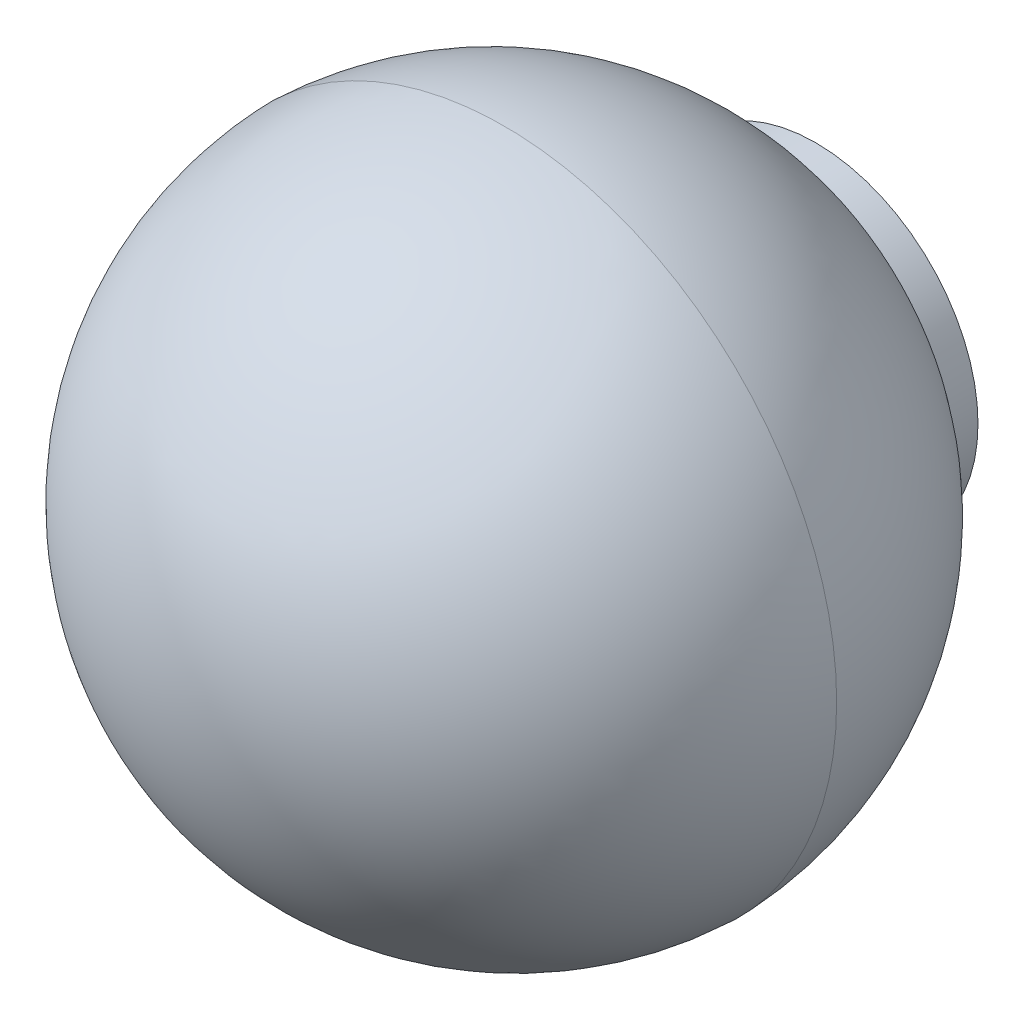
ISO-10303-21;
HEADER;
FILE_DESCRIPTION(('STEP AP214'),'2;1');
FILE_NAME('part.step','',(''),(''),'','','');
FILE_SCHEMA(('AUTOMOTIVE_DESIGN { 1 0 10303 214 1 1 1 1 }'));
ENDSEC;
DATA;
#1=APPLICATION_CONTEXT('core data for automotive mechanical design processes');
#2=APPLICATION_PROTOCOL_DEFINITION('international standard','automotive_design',2000,#1);
#3=PRODUCT_CONTEXT('',#1,'mechanical');
#4=PRODUCT('Part','Part','',(#3));
#5=PRODUCT_RELATED_PRODUCT_CATEGORY('part','',(#4));
#6=PRODUCT_DEFINITION_FORMATION('','',#4);
#7=PRODUCT_DEFINITION_CONTEXT('part definition',#1,'design');
#8=PRODUCT_DEFINITION('design','',#6,#7);
#9=PRODUCT_DEFINITION_SHAPE('','',#8);
#10=(LENGTH_UNIT() NAMED_UNIT(*) SI_UNIT(.MILLI.,.METRE.));
#11=(NAMED_UNIT(*) PLANE_ANGLE_UNIT() SI_UNIT($,.RADIAN.));
#12=(NAMED_UNIT(*) SI_UNIT($,.STERADIAN.) SOLID_ANGLE_UNIT());
#13=UNCERTAINTY_MEASURE_WITH_UNIT(LENGTH_MEASURE(1.E-05),#10,'distance_accuracy_value','');
#14=(GEOMETRIC_REPRESENTATION_CONTEXT(3) GLOBAL_UNCERTAINTY_ASSIGNED_CONTEXT((#13)) GLOBAL_UNIT_ASSIGNED_CONTEXT((#10,
#11,#12)) REPRESENTATION_CONTEXT('',''));
#15=CARTESIAN_POINT('',(0.,0.,0.));
#16=DIRECTION('',(0.,0.,1.));
#17=DIRECTION('',(1.,0.,0.));
#18=AXIS2_PLACEMENT_3D('',#15,#16,#17);
#19=CARTESIAN_POINT('',(0.,0.,19.4624597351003));
#20=DIRECTION('',(0.,0.,-1.));
#21=DIRECTION('',(1.,0.,0.));
#22=AXIS2_PLACEMENT_3D('',#19,#20,#21);
#23=SPHERICAL_SURFACE('',#22,20.);
#24=CARTESIAN_POINT('',(0.,0.,18.7312298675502));
#25=DIRECTION('',(0.,0.,-1.));
#26=DIRECTION('',(0.,1.,0.));
#27=AXIS2_PLACEMENT_3D('',#24,#25,#26);
#28=CIRCLE('',#27,19.9866281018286);
#29=CARTESIAN_POINT('',(19.9866281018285,0.,18.7312298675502));
#30=VERTEX_POINT('',#29);
#31=EDGE_CURVE('E8',#30,#30,#28,.T.);
#32=CARTESIAN_POINT('',(0.,0.,2.00000000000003));
#33=DIRECTION('',(0.,0.,-1.));
#34=DIRECTION('',(0.,1.,0.));
#35=AXIS2_PLACEMENT_3D('',#32,#33,#34);
#36=CIRCLE('',#35,9.75);
#37=CARTESIAN_POINT('',(9.75000000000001,0.,2.00000000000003));
#38=VERTEX_POINT('',#37);
#39=EDGE_CURVE('E22',#38,#38,#36,.T.);
#40=CARTESIAN_POINT('',(19.9866281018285,0.,18.7312298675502));
#41=CARTESIAN_POINT('',(19.9788219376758,0.,18.5178303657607));
#42=CARTESIAN_POINT('',(19.967595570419,0.,18.304556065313));
#43=CARTESIAN_POINT('',(19.9383194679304,0.,17.8784762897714));
#44=CARTESIAN_POINT('',(19.9202697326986,0.,17.6656708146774));
#45=CARTESIAN_POINT('',(19.8773639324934,0.,17.2407471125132));
#46=CARTESIAN_POINT('',(19.85250786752,0.,17.0286288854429));
#47=CARTESIAN_POINT('',(19.7960153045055,0.,16.6052972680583));
#48=CARTESIAN_POINT('',(19.7643788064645,0.,16.3940838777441));
#49=CARTESIAN_POINT('',(19.6943577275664,0.,15.9727786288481));
#50=CARTESIAN_POINT('',(19.6559731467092,0.,15.7626867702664));
#51=CARTESIAN_POINT('',(19.572495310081,0.,15.3438401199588));
#52=CARTESIAN_POINT('',(19.5274020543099,0.,15.135085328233));
#53=CARTESIAN_POINT('',(19.4305531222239,0.,14.7191269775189));
#54=CARTESIAN_POINT('',(19.3787974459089,0.,14.5119234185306));
#55=CARTESIAN_POINT('',(19.2686767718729,0.,14.0992801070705));
#56=CARTESIAN_POINT('',(19.2103117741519,0.,13.8938403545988));
#57=CARTESIAN_POINT('',(19.0870323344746,0.,13.4849354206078));
#58=CARTESIAN_POINT('',(19.0221178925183,0.,13.2814702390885));
#59=CARTESIAN_POINT('',(18.88580616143,0.,12.8767231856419));
#60=CARTESIAN_POINT('',(18.814408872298,0.,12.6754413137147));
#61=CARTESIAN_POINT('',(18.6652046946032,0.,12.2752673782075));
#62=CARTESIAN_POINT('',(18.5873978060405,0.,12.0763753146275));
#63=CARTESIAN_POINT('',(18.4254542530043,0.,11.6811850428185));
#64=CARTESIAN_POINT('',(18.3413175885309,0.,11.4848868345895));
#65=CARTESIAN_POINT('',(18.166800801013,0.,11.0950856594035));
#66=CARTESIAN_POINT('',(18.0764206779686,0.,10.9015826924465));
#67=CARTESIAN_POINT('',(17.8895096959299,0.,10.517570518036));
#68=CARTESIAN_POINT('',(17.7929788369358,0.,10.3270613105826));
#69=CARTESIAN_POINT('',(17.5938654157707,0.,9.94923210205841));
#70=CARTESIAN_POINT('',(17.4912828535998,0.,9.76191210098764));
#71=CARTESIAN_POINT('',(17.2801712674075,0.,9.39065348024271));
#72=CARTESIAN_POINT('',(17.171642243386,0.,9.20671486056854));
#73=CARTESIAN_POINT('',(16.9487490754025,0.,8.84240770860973));
#74=CARTESIAN_POINT('',(16.8343849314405,0.,8.66203917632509));
#75=CARTESIAN_POINT('',(16.599938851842,0.,8.30505724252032));
#76=CARTESIAN_POINT('',(16.4798569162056,0.,8.12844384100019));
#77=CARTESIAN_POINT('',(16.2340984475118,0.,7.7791533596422));
#78=CARTESIAN_POINT('',(16.1084219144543,0.,7.60647627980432));
#79=CARTESIAN_POINT('',(15.8516031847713,0.,7.26523559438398));
#80=CARTESIAN_POINT('',(15.7204609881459,0.,7.09667198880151));
#81=CARTESIAN_POINT('',(15.4528454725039,0.,6.76383118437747));
#82=CARTESIAN_POINT('',(15.3163721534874,0.,6.59955398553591));
#83=CARTESIAN_POINT('',(15.0382344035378,0.,6.27545452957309));
#84=CARTESIAN_POINT('',(14.8965699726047,0.,6.11563227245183));
#85=CARTESIAN_POINT('',(14.6081953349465,0.,5.80060666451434));
#86=CARTESIAN_POINT('',(14.4614851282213,0.,5.6454033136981));
#87=CARTESIAN_POINT('',(14.1631694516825,0.,5.3397747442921));
#88=CARTESIAN_POINT('',(14.0115639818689,0.,5.18934952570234));
#89=CARTESIAN_POINT('',(13.7036133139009,0.,4.89343154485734));
#90=CARTESIAN_POINT('',(13.5472681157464,0.,4.7479387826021));
#91=CARTESIAN_POINT('',(13.2299983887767,0.,4.4620349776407));
#92=CARTESIAN_POINT('',(13.0690738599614,0.,4.32162393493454));
#93=CARTESIAN_POINT('',(12.7428105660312,0.,4.04602762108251));
#94=CARTESIAN_POINT('',(12.5774718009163,0.,3.91084234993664));
#95=CARTESIAN_POINT('',(12.2425496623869,0.,3.64583626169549));
#96=CARTESIAN_POINT('',(12.0729662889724,0.,3.51601544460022));
#97=CARTESIAN_POINT('',(11.7297288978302,0.,3.26187147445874));
#98=CARTESIAN_POINT('',(11.5560748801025,0.,3.13754832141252));
#99=CARTESIAN_POINT('',(11.2048744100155,0.,2.89452713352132));
#100=CARTESIAN_POINT('',(11.0273279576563,0.,2.77582909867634));
#101=CARTESIAN_POINT('',(10.6685245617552,0.,2.54418026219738));
#102=CARTESIAN_POINT('',(10.4872676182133,0.,2.43122946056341));
#103=CARTESIAN_POINT('',(10.1212299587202,0.,2.21118969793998));
#104=CARTESIAN_POINT('',(9.93644924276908,0.,2.10410073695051));
#105=CARTESIAN_POINT('',(9.75000000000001,0.,2.00000000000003));
#106=B_SPLINE_CURVE_WITH_KNOTS('',3,(#40,#41,#42,#43,#44,#45,#46,#47,#48,#49,#50,#51,#52,#53,
#54,#55,#56,#57,#58,#59,#60,#61,#62,#63,#64,#65,#66,#67,#68,#69,#70,#71,#72,#73,#74,#75,#76,#77,
#78,#79,#80,#81,#82,#83,#84,#85,#86,#87,#88,#89,#90,#91,#92,#93,#94,#95,#96,#97,#98,#99,#100,
#101,#102,#103,#104,#105),.UNSPECIFIED.,.F.,.F.,(4,2,2,2,2,2,2,2,2,2,2,2,2,2,2,2,2,2,2,2,2,2,2,
2,2,2,2,2,2,2,2,2,4),(0.,0.640599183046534,1.28119836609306,1.9217975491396,2.56239673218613,
3.20299591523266,3.84359509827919,4.48419428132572,5.12479346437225,5.76539264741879,
6.40599183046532,7.04659101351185,7.68719019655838,8.32778937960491,8.96838856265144,
9.60898774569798,10.2495869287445,10.890186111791,11.5307852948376,12.1713844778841,
12.8119836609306,13.4525828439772,14.0931820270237,14.7337812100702,15.3743803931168,
16.0149795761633,16.6555787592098,17.2961779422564,17.9367771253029,18.5773763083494,
19.217975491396,19.8585746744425,20.499173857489),.UNSPECIFIED.);
#107=EDGE_CURVE('BSEAM12',#30,#38,#106,.T.);
#108=ORIENTED_EDGE('',*,*,#31,.T.);
#109=ORIENTED_EDGE('',*,*,#39,.F.);
#110=ORIENTED_EDGE('',*,*,#107,.T.);
#111=ORIENTED_EDGE('',*,*,#107,.F.);
#112=EDGE_LOOP('',(#108,#110,#109,#111));
#113=FACE_BOUND('',#112,.T.);
#114=ADVANCED_FACE('F12',(#113),#23,.T.);
#115=CARTESIAN_POINT('',(0.,0.,18.));
#116=DIRECTION('',(0.,0.,-1.));
#117=DIRECTION('',(1.,0.,0.));
#118=AXIS2_PLACEMENT_3D('',#115,#116,#117);
#119=SPHERICAL_SURFACE('',#118,20.);
#120=ORIENTED_EDGE('',*,*,#31,.F.);
#121=EDGE_LOOP('',(#120));
#122=FACE_BOUND('',#121,.T.);
#123=ADVANCED_FACE('F40',(#122),#119,.T.);
#124=CARTESIAN_POINT('',(0.,0.,0.));
#125=DIRECTION('',(0.,0.,-1.));
#126=DIRECTION('',(0.,1.,0.));
#127=AXIS2_PLACEMENT_3D('',#124,#125,#126);
#128=PLANE('',#127);
#129=CARTESIAN_POINT('',(0.,0.,0.));
#130=DIRECTION('',(0.,0.,-1.));
#131=DIRECTION('',(0.,1.,0.));
#132=AXIS2_PLACEMENT_3D('',#129,#130,#131);
#133=CIRCLE('',#132,5.);
#134=CARTESIAN_POINT('',(0.,5.,0.));
#135=VERTEX_POINT('',#134);
#136=EDGE_CURVE('E31',#135,#135,#133,.T.);
#137=ORIENTED_EDGE('',*,*,#136,.F.);
#138=EDGE_LOOP('',(#137));
#139=FACE_BOUND('',#138,.T.);
#140=CARTESIAN_POINT('',(0.,0.,0.));
#141=DIRECTION('',(0.,0.,-1.));
#142=DIRECTION('',(0.,1.,0.));
#143=AXIS2_PLACEMENT_3D('',#140,#141,#142);
#144=CIRCLE('',#143,9.75);
#145=CARTESIAN_POINT('',(0.,9.75,0.));
#146=VERTEX_POINT('',#145);
#147=EDGE_CURVE('E18',#146,#146,#144,.T.);
#148=ORIENTED_EDGE('',*,*,#147,.T.);
#149=EDGE_LOOP('',(#148));
#150=FACE_BOUND('',#149,.T.);
#151=ADVANCED_FACE('F37',(#139,#150),#128,.T.);
#152=CARTESIAN_POINT('',(0.,0.,0.));
#153=DIRECTION('',(0.,0.,-1.));
#154=DIRECTION('',(0.,1.,0.));
#155=AXIS2_PLACEMENT_3D('',#152,#153,#154);
#156=CYLINDRICAL_SURFACE('',#155,9.75);
#157=ORIENTED_EDGE('',*,*,#39,.T.);
#158=EDGE_LOOP('',(#157));
#159=FACE_BOUND('',#158,.T.);
#160=ORIENTED_EDGE('',*,*,#147,.F.);
#161=EDGE_LOOP('',(#160));
#162=FACE_BOUND('',#161,.T.);
#163=ADVANCED_FACE('F39',(#159,#162),#156,.T.);
#164=CARTESIAN_POINT('',(0.,0.,15.));
#165=DIRECTION('',(0.,0.,-1.));
#166=DIRECTION('',(0.,1.,0.));
#167=AXIS2_PLACEMENT_3D('',#164,#165,#166);
#168=CYLINDRICAL_SURFACE('',#167,5.);
#169=CARTESIAN_POINT('',(0.,0.,15.));
#170=DIRECTION('',(0.,0.,-1.));
#171=DIRECTION('',(0.,1.,0.));
#172=AXIS2_PLACEMENT_3D('',#169,#170,#171);
#173=CIRCLE('',#172,5.);
#174=CARTESIAN_POINT('',(0.,5.,15.));
#175=VERTEX_POINT('',#174);
#176=EDGE_CURVE('E26',#175,#175,#173,.T.);
#177=ORIENTED_EDGE('',*,*,#176,.F.);
#178=EDGE_LOOP('',(#177));
#179=FACE_BOUND('',#178,.T.);
#180=ORIENTED_EDGE('',*,*,#136,.T.);
#181=EDGE_LOOP('',(#180));
#182=FACE_BOUND('',#181,.T.);
#183=ADVANCED_FACE('F35',(#179,#182),#168,.F.);
#184=CARTESIAN_POINT('',(0.,0.,15.));
#185=DIRECTION('',(0.,0.,-1.));
#186=DIRECTION('',(0.,1.,0.));
#187=AXIS2_PLACEMENT_3D('',#184,#185,#186);
#188=PLANE('',#187);
#189=ORIENTED_EDGE('',*,*,#176,.T.);
#190=EDGE_LOOP('',(#189));
#191=FACE_BOUND('',#190,.T.);
#192=ADVANCED_FACE('F88',(#191),#188,.T.);
#193=CLOSED_SHELL('',(#114,#123,#151,#163,#183,#192));
#194=MANIFOLD_SOLID_BREP('B1',#193);
#195=ADVANCED_BREP_SHAPE_REPRESENTATION('',(#18,#194),#14);
#196=SHAPE_DEFINITION_REPRESENTATION(#9,#195);
ENDSEC;
END-ISO-10303-21;
